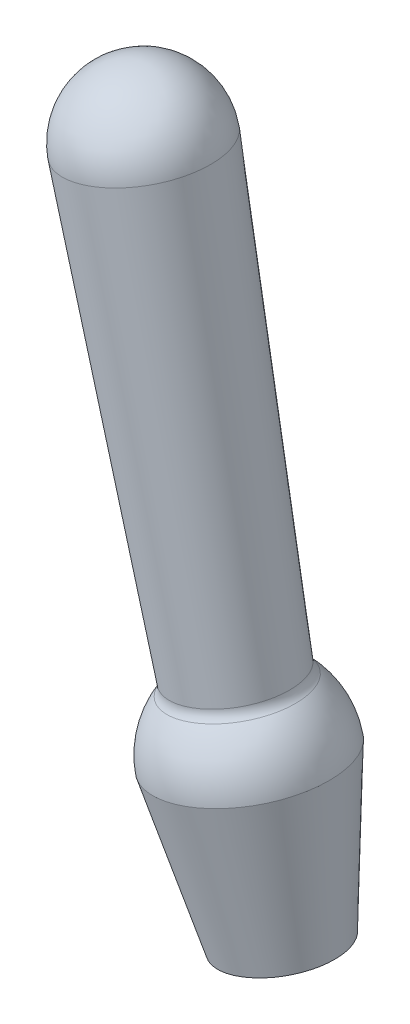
ISO-10303-21;
HEADER;
FILE_DESCRIPTION(('STEP AP214'),'2;1');
FILE_NAME('part.step','',(''),(''),'','','');
FILE_SCHEMA(('AUTOMOTIVE_DESIGN { 1 0 10303 214 1 1 1 1 }'));
ENDSEC;
DATA;
#1=APPLICATION_CONTEXT('core data for automotive mechanical design processes');
#2=APPLICATION_PROTOCOL_DEFINITION('international standard','automotive_design',2000,#1);
#3=PRODUCT_CONTEXT('',#1,'mechanical');
#4=PRODUCT('Part','Part','',(#3));
#5=PRODUCT_RELATED_PRODUCT_CATEGORY('part','',(#4));
#6=PRODUCT_DEFINITION_FORMATION('','',#4);
#7=PRODUCT_DEFINITION_CONTEXT('part definition',#1,'design');
#8=PRODUCT_DEFINITION('design','',#6,#7);
#9=PRODUCT_DEFINITION_SHAPE('','',#8);
#10=(LENGTH_UNIT() NAMED_UNIT(*) SI_UNIT(.MILLI.,.METRE.));
#11=(NAMED_UNIT(*) PLANE_ANGLE_UNIT() SI_UNIT($,.RADIAN.));
#12=(NAMED_UNIT(*) SI_UNIT($,.STERADIAN.) SOLID_ANGLE_UNIT());
#13=UNCERTAINTY_MEASURE_WITH_UNIT(LENGTH_MEASURE(1.E-05),#10,'distance_accuracy_value','');
#14=(GEOMETRIC_REPRESENTATION_CONTEXT(3) GLOBAL_UNCERTAINTY_ASSIGNED_CONTEXT((#13)) GLOBAL_UNIT_ASSIGNED_CONTEXT((#10,
#11,#12)) REPRESENTATION_CONTEXT('',''));
#15=CARTESIAN_POINT('',(0.,0.,0.));
#16=DIRECTION('',(0.,0.,1.));
#17=DIRECTION('',(1.,0.,0.));
#18=AXIS2_PLACEMENT_3D('',#15,#16,#17);
#19=CARTESIAN_POINT('',(-0.261764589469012,10.2358437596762,0.));
#20=DIRECTION('',(0.216439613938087,-0.976296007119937,0.));
#21=DIRECTION('',(0.976170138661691,0.216411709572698,-0.0160571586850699));
#22=AXIS2_PLACEMENT_3D('',#19,#20,#21);
#23=TOROIDAL_SURFACE('',#22,1.28592669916,0.254);
#24=CARTESIAN_POINT('',(-0.263435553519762,10.2433809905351,0.));
#25=DIRECTION('',(0.216439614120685,-0.976296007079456,0.));
#26=DIRECTION('',(0.976296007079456,0.216439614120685,0.));
#27=AXIS2_PLACEMENT_3D('',#24,#25,#26);
#28=CIRCLE('',#27,1.0320441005);
#29=CARTESIAN_POINT('',(0.744144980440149,10.4667562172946,0.));
#30=VERTEX_POINT('',#29);
#31=EDGE_CURVE('E83',#30,#30,#28,.T.);
#32=ORIENTED_EDGE('',*,*,#31,.T.);
#33=EDGE_LOOP('',(#32));
#34=FACE_BOUND('',#33,.T.);
#35=CARTESIAN_POINT('',(-0.224100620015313,10.0659525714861,0.));
#36=DIRECTION('',(0.216439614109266,-0.976296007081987,0.));
#37=DIRECTION('',(0.976296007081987,0.216439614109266,0.));
#38=AXIS2_PLACEMENT_3D('',#35,#36,#37);
#39=CIRCLE('',#38,1.10090130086);
#40=CARTESIAN_POINT('',(0.850704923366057,10.3042312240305,0.));
#41=VERTEX_POINT('',#40);
#42=EDGE_CURVE('E11',#41,#41,#39,.T.);
#43=ORIENTED_EDGE('',*,*,#42,.F.);
#44=EDGE_LOOP('',(#43));
#45=FACE_BOUND('',#44,.T.);
#46=ADVANCED_FACE('F17',(#34,#45),#23,.F.);
#47=CARTESIAN_POINT('',(-1.95713356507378,17.8831590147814,0.));
#48=DIRECTION('',(0.216439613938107,-0.976296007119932,0.));
#49=DIRECTION('',(-0.976296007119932,-0.216439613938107,0.));
#50=AXIS2_PLACEMENT_3D('',#47,#48,#49);
#51=SPHERICAL_SURFACE('',#50,1.27);
#52=CARTESIAN_POINT('',(-2.23201187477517,19.1230549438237,0.));
#53=VERTEX_POINT('',#52);
#54=VERTEX_LOOP('',#53);
#55=FACE_BOUND('',#54,.T.);
#56=CARTESIAN_POINT('',(-1.95713356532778,17.8831590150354,0.));
#57=DIRECTION('',(0.216439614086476,-0.97629600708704,0.));
#58=DIRECTION('',(0.97629600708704,0.216439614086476,0.));
#59=AXIS2_PLACEMENT_3D('',#56,#57,#58);
#60=CIRCLE('',#59,1.27);
#61=CARTESIAN_POINT('',(-0.717237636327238,18.1580373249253,0.));
#62=VERTEX_POINT('',#61);
#63=EDGE_CURVE('E77',#62,#62,#60,.T.);
#64=ORIENTED_EDGE('',*,*,#63,.F.);
#65=EDGE_LOOP('',(#64));
#66=FACE_BOUND('',#65,.T.);
#67=ADVANCED_FACE('F125',(#55,#66),#51,.T.);
#68=CARTESIAN_POINT('',(0.524347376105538,6.68992183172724,0.));
#69=DIRECTION('',(-0.216439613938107,0.976296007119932,0.));
#70=DIRECTION('',(0.,0.,-1.));
#71=AXIS2_PLACEMENT_3D('',#68,#69,#70);
#72=TOROIDAL_SURFACE('',#71,1.0287,0.381);
#73=CARTESIAN_POINT('',(0.59923471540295,6.35212687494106,0.));
#74=DIRECTION('',(-0.216439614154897,0.976296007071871,0.));
#75=DIRECTION('',(0.,0.,1.));
#76=AXIS2_PLACEMENT_3D('',#73,#74,#75);
#77=CIRCLE('',#76,0.86917740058);
#78=CARTESIAN_POINT('',(0.59923471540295,6.35212687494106,0.8691774));
#79=VERTEX_POINT('',#78);
#80=EDGE_CURVE('E26',#79,#79,#77,.T.);
#81=ORIENTED_EDGE('',*,*,#80,.F.);
#82=EDGE_LOOP('',(#81));
#83=FACE_BOUND('',#82,.T.);
#84=CARTESIAN_POINT('',(0.524347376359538,6.68992183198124,0.));
#85=DIRECTION('',(0.216439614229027,-0.976296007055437,0.));
#86=DIRECTION('',(-0.976296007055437,-0.216439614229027,0.));
#87=AXIS2_PLACEMENT_3D('',#84,#85,#86);
#88=CIRCLE('',#87,0.6477);
#89=CARTESIAN_POINT('',(-0.107999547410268,6.5497338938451,0.));
#90=VERTEX_POINT('',#89);
#91=EDGE_CURVE('E92',#90,#90,#88,.T.);
#92=ORIENTED_EDGE('',*,*,#91,.F.);
#93=EDGE_LOOP('',(#92));
#94=FACE_BOUND('',#93,.T.);
#95=ADVANCED_FACE('F129',(#83,#94),#72,.T.);
#96=CARTESIAN_POINT('',(0.,9.0551,0.));
#97=DIRECTION('',(0.216439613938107,-0.976296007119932,0.));
#98=DIRECTION('',(-0.976296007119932,-0.216439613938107,0.));
#99=AXIS2_PLACEMENT_3D('',#96,#97,#98);
#100=SPHERICAL_SURFACE('',#99,1.5113);
#101=CARTESIAN_POINT('',(0.,9.055100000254,0.));
#102=DIRECTION('',(-0.216439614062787,0.976296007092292,0.));
#103=DIRECTION('',(0.976296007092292,0.216439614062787,0.));
#104=AXIS2_PLACEMENT_3D('',#101,#102,#103);
#105=CIRCLE('',#104,1.5113);
#106=CARTESIAN_POINT('',(1.47547615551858,9.38220518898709,0.));
#107=VERTEX_POINT('',#106);
#108=EDGE_CURVE('E99',#107,#107,#105,.T.);
#109=ORIENTED_EDGE('',*,*,#108,.T.);
#110=EDGE_LOOP('',(#109));
#111=FACE_BOUND('',#110,.T.);
#112=ORIENTED_EDGE('',*,*,#42,.T.);
#113=EDGE_LOOP('',(#112));
#114=FACE_BOUND('',#113,.T.);
#115=ADVANCED_FACE('F106',(#111,#114),#100,.T.);
#116=CARTESIAN_POINT('',(0.59923471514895,6.35212687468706,0.));
#117=DIRECTION('',(0.216439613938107,-0.976296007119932,0.));
#118=DIRECTION('',(0.,0.,-1.));
#119=AXIS2_PLACEMENT_3D('',#116,#117,#118);
#120=PLANE('',#119);
#121=ORIENTED_EDGE('',*,*,#80,.T.);
#122=EDGE_LOOP('',(#121));
#123=FACE_BOUND('',#122,.T.);
#124=CARTESIAN_POINT('',(0.59923471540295,6.35212687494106,0.));
#125=DIRECTION('',(0.216439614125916,-0.976296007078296,0.));
#126=DIRECTION('',(0.976296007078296,0.216439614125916,0.));
#127=AXIS2_PLACEMENT_3D('',#124,#125,#126);
#128=CIRCLE('',#127,1.0033);
#129=CARTESIAN_POINT('',(1.57875249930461,6.5692807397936,0.));
#130=VERTEX_POINT('',#129);
#131=EDGE_CURVE('E96',#130,#130,#128,.T.);
#132=ORIENTED_EDGE('',*,*,#131,.T.);
#133=EDGE_LOOP('',(#132));
#134=FACE_BOUND('',#133,.T.);
#135=ADVANCED_FACE('F138',(#123,#134),#120,.T.);
#136=CARTESIAN_POINT('',(-1.1102845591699,14.0632700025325,0.));
#137=DIRECTION('',(-0.216439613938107,0.976296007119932,0.));
#138=DIRECTION('',(0.976296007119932,0.216439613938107,0.));
#139=AXIS2_PLACEMENT_3D('',#136,#137,#138);
#140=CONICAL_SURFACE('',#139,1.15102200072,0.0303992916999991);
#141=ORIENTED_EDGE('',*,*,#31,.F.);
#142=EDGE_LOOP('',(#141));
#143=FACE_BOUND('',#142,.T.);
#144=ORIENTED_EDGE('',*,*,#63,.T.);
#145=EDGE_LOOP('',(#144));
#146=FACE_BOUND('',#145,.T.);
#147=ADVANCED_FACE('F119',(#143,#146),#140,.T.);
#148=CARTESIAN_POINT('',(0.59923471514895,6.35212687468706,0.));
#149=DIRECTION('',(0.216439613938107,-0.976296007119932,0.));
#150=DIRECTION('',(0.976296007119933,0.216439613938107,0.));
#151=AXIS2_PLACEMENT_3D('',#148,#149,#150);
#152=CYLINDRICAL_SURFACE('',#151,0.6477);
#153=ORIENTED_EDGE('',*,*,#91,.T.);
#154=EDGE_LOOP('',(#153));
#155=FACE_BOUND('',#154,.T.);
#156=CARTESIAN_POINT('',(-1.02254731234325,13.6675128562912,0.));
#157=DIRECTION('',(-0.216439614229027,0.976296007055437,0.));
#158=DIRECTION('',(0.976296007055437,0.216439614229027,0.));
#159=AXIS2_PLACEMENT_3D('',#156,#157,#158);
#160=CIRCLE('',#159,0.6477);
#161=CARTESIAN_POINT('',(-0.390200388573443,13.8077007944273,0.));
#162=VERTEX_POINT('',#161);
#163=EDGE_CURVE('E56',#162,#162,#160,.T.);
#164=ORIENTED_EDGE('',*,*,#163,.T.);
#165=EDGE_LOOP('',(#164));
#166=FACE_BOUND('',#165,.T.);
#167=ADVANCED_FACE('F111',(#155,#166),#152,.F.);
#168=CARTESIAN_POINT('',(0.299617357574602,7.7036134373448,0.));
#169=DIRECTION('',(-0.216439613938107,0.976296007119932,0.));
#170=DIRECTION('',(0.976296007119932,0.216439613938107,0.));
#171=AXIS2_PLACEMENT_3D('',#168,#169,#170);
#172=CONICAL_SURFACE('',#171,1.2573,0.1814677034);
#173=ORIENTED_EDGE('',*,*,#131,.F.);
#174=EDGE_LOOP('',(#173));
#175=FACE_BOUND('',#174,.T.);
#176=ORIENTED_EDGE('',*,*,#108,.F.);
#177=EDGE_LOOP('',(#176));
#178=FACE_BOUND('',#177,.T.);
#179=ADVANCED_FACE('F108',(#175,#178),#172,.T.);
#180=CARTESIAN_POINT('',(-1.07884635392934,13.9214614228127,0.));
#181=DIRECTION('',(0.216439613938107,-0.976296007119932,0.));
#182=DIRECTION('',(0.,0.,1.));
#183=AXIS2_PLACEMENT_3D('',#180,#181,#182);
#184=CONICAL_SURFACE('',#183,0.330327,0.884226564);
#185=CARTESIAN_POINT('',(-1.13744331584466,14.1857752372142,0.));
#186=VERTEX_POINT('',#185);
#187=VERTEX_LOOP('',#186);
#188=FACE_BOUND('',#187,.T.);
#189=ORIENTED_EDGE('',*,*,#163,.F.);
#190=EDGE_LOOP('',(#189));
#191=FACE_BOUND('',#190,.T.);
#192=ADVANCED_FACE('F110',(#188,#191),#184,.F.);
#193=CLOSED_SHELL('',(#46,#67,#95,#115,#135,#147,#167,#179,#192));
#194=MANIFOLD_SOLID_BREP('B1',#193);
#195=ADVANCED_BREP_SHAPE_REPRESENTATION('',(#18,#194),#14);
#196=SHAPE_DEFINITION_REPRESENTATION(#9,#195);
ENDSEC;
END-ISO-10303-21;
